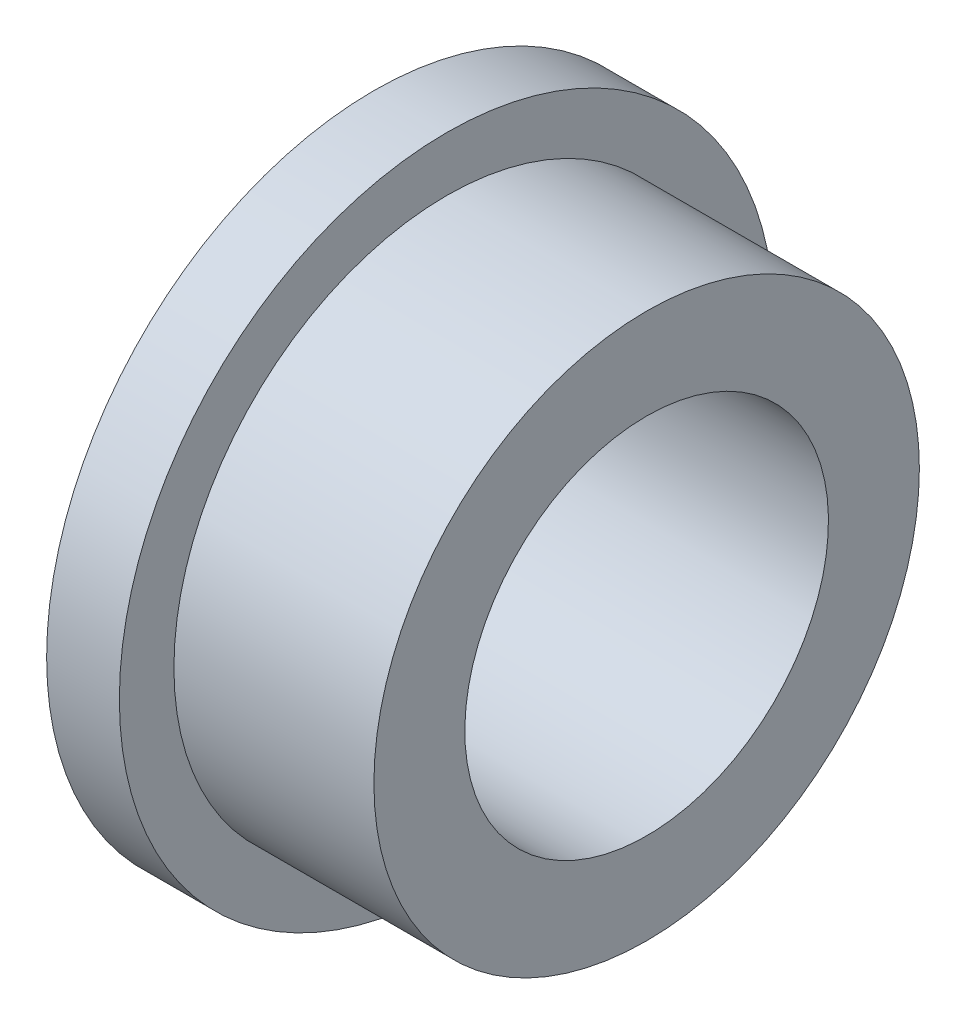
from build123d import *


with BuildPart() as part:
    # Esquisse1 → Base-R_volution (revolve)
    with BuildSketch(Plane.XY):
        Polygon((0, 5), (-7.5, 5), (-7.5, 9), (-5.5, 9), (-5.5, 7.5), (0, 7.5), align=None)
    revolve(axis=Axis((0, 0, 0), (-1, 0, 0)))


solid = part.part
